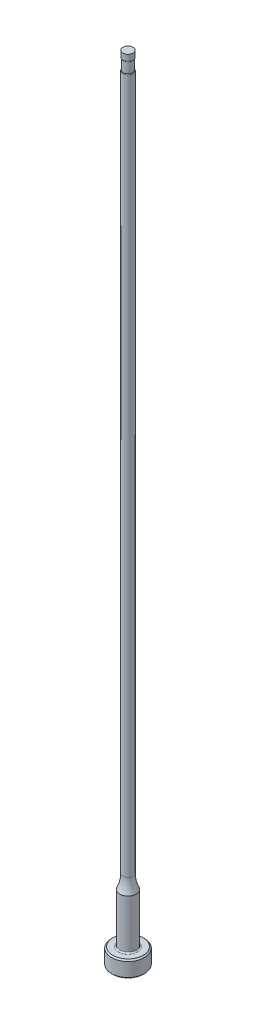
ISO-10303-21;
HEADER;
FILE_DESCRIPTION(('STEP AP214'),'2;1');
FILE_NAME('part.step','',(''),(''),'','','');
FILE_SCHEMA(('AUTOMOTIVE_DESIGN { 1 0 10303 214 1 1 1 1 }'));
ENDSEC;
DATA;
#1=APPLICATION_CONTEXT('core data for automotive mechanical design processes');
#2=APPLICATION_PROTOCOL_DEFINITION('international standard','automotive_design',2000,#1);
#3=PRODUCT_CONTEXT('',#1,'mechanical');
#4=PRODUCT('Part','Part','',(#3));
#5=PRODUCT_RELATED_PRODUCT_CATEGORY('part','',(#4));
#6=PRODUCT_DEFINITION_FORMATION('','',#4);
#7=PRODUCT_DEFINITION_CONTEXT('part definition',#1,'design');
#8=PRODUCT_DEFINITION('design','',#6,#7);
#9=PRODUCT_DEFINITION_SHAPE('','',#8);
#10=(LENGTH_UNIT() NAMED_UNIT(*) SI_UNIT(.MILLI.,.METRE.));
#11=(NAMED_UNIT(*) PLANE_ANGLE_UNIT() SI_UNIT($,.RADIAN.));
#12=(NAMED_UNIT(*) SI_UNIT($,.STERADIAN.) SOLID_ANGLE_UNIT());
#13=UNCERTAINTY_MEASURE_WITH_UNIT(LENGTH_MEASURE(1.E-05),#10,'distance_accuracy_value','');
#14=(GEOMETRIC_REPRESENTATION_CONTEXT(3) GLOBAL_UNCERTAINTY_ASSIGNED_CONTEXT((#13)) GLOBAL_UNIT_ASSIGNED_CONTEXT((#10,
#11,#12)) REPRESENTATION_CONTEXT('',''));
#15=CARTESIAN_POINT('',(0.,0.,0.));
#16=DIRECTION('',(0.,0.,1.));
#17=DIRECTION('',(1.,0.,0.));
#18=AXIS2_PLACEMENT_3D('',#15,#16,#17);
#19=CARTESIAN_POINT('',(0.,259.958771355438,0.));
#20=DIRECTION('',(0.,1.,0.));
#21=DIRECTION('',(0.,0.,1.));
#22=AXIS2_PLACEMENT_3D('',#19,#20,#21);
#23=CYLINDRICAL_SURFACE('',#22,0.991869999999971);
#24=DIRECTION('',(0.,1.,0.));
#25=VECTOR('',#24,1.);
#26=CARTESIAN_POINT('',(-0.890269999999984,259.958771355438,-0.437293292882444));
#27=LINE('',#26,#25);
#28=CARTESIAN_POINT('',(-0.890269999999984,148.973565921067,-0.437293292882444));
#29=VERTEX_POINT('',#28);
#30=CARTESIAN_POINT('',(-0.890269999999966,112.014,-0.43729329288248));
#31=VERTEX_POINT('',#30);
#32=EDGE_CURVE('E66',#29,#31,#27,.F.);
#33=ORIENTED_EDGE('',*,*,#32,.F.);
#34=CARTESIAN_POINT('',(0.,148.973565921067,0.));
#35=DIRECTION('',(0.,1.,0.));
#36=DIRECTION('',(0.,0.,1.));
#37=AXIS2_PLACEMENT_3D('',#34,#35,#36);
#38=CIRCLE('',#37,0.991869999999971);
#39=CARTESIAN_POINT('',(-0.890269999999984,148.973565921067,0.437293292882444));
#40=VERTEX_POINT('',#39);
#41=EDGE_CURVE('E44',#29,#40,#38,.F.);
#42=ORIENTED_EDGE('',*,*,#41,.T.);
#43=DIRECTION('',(0.,1.,0.));
#44=VECTOR('',#43,1.);
#45=CARTESIAN_POINT('',(-0.890269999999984,259.958771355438,0.437293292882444));
#46=LINE('',#45,#44);
#47=CARTESIAN_POINT('',(-0.890269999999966,112.014,0.43729329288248));
#48=VERTEX_POINT('',#47);
#49=EDGE_CURVE('E72',#48,#40,#46,.T.);
#50=ORIENTED_EDGE('',*,*,#49,.F.);
#51=CARTESIAN_POINT('',(-0.890269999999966,112.014,-0.43729329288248));
#52=CARTESIAN_POINT('',(-0.890266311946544,111.980545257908,-0.437278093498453));
#53=CARTESIAN_POINT('',(-0.890798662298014,111.947083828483,-0.436215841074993));
#54=CARTESIAN_POINT('',(-0.89291221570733,111.8802670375,-0.431885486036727));
#55=CARTESIAN_POINT('',(-0.8944956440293,111.846912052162,-0.428612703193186));
#56=CARTESIAN_POINT('',(-0.898710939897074,111.780207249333,-0.419700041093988));
#57=CARTESIAN_POINT('',(-0.901354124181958,111.7468615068,-0.41403457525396));
#58=CARTESIAN_POINT('',(-0.907624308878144,111.680839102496,-0.400103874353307));
#59=CARTESIAN_POINT('',(-0.911250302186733,111.648161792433,-0.391841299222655));
#60=CARTESIAN_POINT('',(-0.919626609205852,111.581872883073,-0.371778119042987));
#61=CARTESIAN_POINT('',(-0.924431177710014,111.54832221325,-0.359795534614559));
#62=CARTESIAN_POINT('',(-0.934806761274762,111.48304822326,-0.331911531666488));
#63=CARTESIAN_POINT('',(-0.940375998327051,111.451320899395,-0.316019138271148));
#64=CARTESIAN_POINT('',(-0.950464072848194,111.398247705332,-0.283956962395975));
#65=CARTESIAN_POINT('',(-0.954903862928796,111.376269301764,-0.268819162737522));
#66=CARTESIAN_POINT('',(-0.963691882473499,111.334821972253,-0.235377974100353));
#67=CARTESIAN_POINT('',(-0.968040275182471,111.315348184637,-0.217080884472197));
#68=CARTESIAN_POINT('',(-0.974794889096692,111.286172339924,-0.183749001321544));
#69=CARTESIAN_POINT('',(-0.977361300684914,111.275390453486,-0.169697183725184));
#70=CARTESIAN_POINT('',(-0.982046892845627,111.256069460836,-0.140050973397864));
#71=CARTESIAN_POINT('',(-0.984166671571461,111.247527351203,-0.124458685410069));
#72=CARTESIAN_POINT('',(-0.987438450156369,111.234502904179,-0.0946420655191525));
#73=CARTESIAN_POINT('',(-0.988692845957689,111.229581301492,-0.080622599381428));
#74=CARTESIAN_POINT('',(-0.990613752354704,111.222085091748,-0.0519284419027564));
#75=CARTESIAN_POINT('',(-0.991280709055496,111.219508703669,-0.0372542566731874));
#76=CARTESIAN_POINT('',(-0.991951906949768,111.21691599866,-0.00760975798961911));
#77=CARTESIAN_POINT('',(-0.99195380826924,111.216908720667,0.00736141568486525));
#78=CARTESIAN_POINT('',(-0.991288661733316,111.219477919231,0.0370648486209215));
#79=CARTESIAN_POINT('',(-0.990621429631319,111.222055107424,0.0517970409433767));
#80=CARTESIAN_POINT('',(-0.988743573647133,111.229383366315,0.0798806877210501));
#81=CARTESIAN_POINT('',(-0.987561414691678,111.234020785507,0.0932643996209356));
#82=CARTESIAN_POINT('',(-0.984768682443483,111.245124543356,0.119193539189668));
#83=CARTESIAN_POINT('',(-0.983157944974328,111.251591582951,0.131738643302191));
#84=CARTESIAN_POINT('',(-0.978661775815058,111.269953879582,0.162424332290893));
#85=CARTESIAN_POINT('',(-0.975558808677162,111.282890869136,0.179909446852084));
#86=CARTESIAN_POINT('',(-0.96896763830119,111.31132520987,0.212571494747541));
#87=CARTESIAN_POINT('',(-0.965478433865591,111.326829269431,0.227742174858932));
#88=CARTESIAN_POINT('',(-0.95629354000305,111.369332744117,0.264288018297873));
#89=CARTESIAN_POINT('',(-0.950512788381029,111.397709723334,0.284029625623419));
#90=CARTESIAN_POINT('',(-0.939335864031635,111.457144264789,0.319042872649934));
#91=CARTESIAN_POINT('',(-0.933940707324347,111.488208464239,0.334303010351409));
#92=CARTESIAN_POINT('',(-0.920397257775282,111.574246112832,0.370513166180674));
#93=CARTESIAN_POINT('',(-0.912954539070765,111.630778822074,0.388004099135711));
#94=CARTESIAN_POINT('',(-0.901068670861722,111.745979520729,0.414830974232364));
#95=CARTESIAN_POINT('',(-0.896628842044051,111.804649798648,0.424157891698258));
#96=CARTESIAN_POINT('',(-0.892643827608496,111.888710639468,0.432432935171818));
#97=CARTESIAN_POINT('',(-0.891752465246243,111.913788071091,0.434264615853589));
#98=CARTESIAN_POINT('',(-0.890566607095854,111.963908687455,0.43669067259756));
#99=CARTESIAN_POINT('',(-0.890269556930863,111.988951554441,0.437290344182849));
#100=CARTESIAN_POINT('',(-0.890269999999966,112.014,0.43729329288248));
#101=B_SPLINE_CURVE_WITH_KNOTS('',3,(#51,#52,#53,#54,#55,#56,#57,#58,#59,#60,#61,#62,#63,#64,
#65,#66,#67,#68,#69,#70,#71,#72,#73,#74,#75,#76,#77,#78,#79,#80,#81,#82,#83,#84,#85,#86,#87,#88,
#89,#90,#91,#92,#93,#94,#95,#96,#97,#98,#99,#100),.UNSPECIFIED.,.F.,.F.,(4,2,2,2,2,2,2,2,2,2,2,
2,2,2,2,2,2,2,2,2,2,2,2,2,4),(0.,0.10035396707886,0.200921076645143,0.302591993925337,
0.404159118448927,0.511798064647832,0.619190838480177,0.700138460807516,0.780926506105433,
0.834449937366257,0.887901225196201,0.93244760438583,0.976960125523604,1.02162925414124,
1.06631068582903,1.10878536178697,1.15127633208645,1.21681290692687,1.28252352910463,
1.38707795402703,1.49189842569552,1.66985552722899,1.84800909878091,1.92345875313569,
1.99858341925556),.UNSPECIFIED.);
#102=EDGE_CURVE('E74',#31,#48,#101,.T.);
#103=ORIENTED_EDGE('',*,*,#102,.F.);
#104=EDGE_LOOP('',(#33,#42,#50,#103));
#105=FACE_BOUND('',#104,.T.);
#106=CARTESIAN_POINT('',(0.,15.3850932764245,0.));
#107=DIRECTION('',(0.,1.,0.));
#108=DIRECTION('',(0.,0.,1.));
#109=AXIS2_PLACEMENT_3D('',#106,#107,#108);
#110=CIRCLE('',#109,0.991869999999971);
#111=CARTESIAN_POINT('',(0.,15.3850932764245,0.991869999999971));
#112=VERTEX_POINT('',#111);
#113=EDGE_CURVE('E95',#112,#112,#110,.T.);
#114=ORIENTED_EDGE('',*,*,#113,.T.);
#115=EDGE_LOOP('',(#114));
#116=FACE_BOUND('',#115,.T.);
#117=ADVANCED_FACE('F36',(#105,#116),#23,.T.);
#118=CARTESIAN_POINT('',(0.,15.3850932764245,0.));
#119=DIRECTION('',(0.,1.,0.));
#120=DIRECTION('',(0.,0.,1.));
#121=AXIS2_PLACEMENT_3D('',#118,#119,#120);
#122=TOROIDAL_SURFACE('',#121,7.34186999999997,6.35);
#123=CARTESIAN_POINT('',(0.,12.7,0.));
#124=DIRECTION('',(0.,1.,0.));
#125=DIRECTION('',(0.,0.,1.));
#126=AXIS2_PLACEMENT_3D('',#123,#124,#125);
#127=CIRCLE('',#126,1.58749999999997);
#128=CARTESIAN_POINT('',(0.,12.7,1.58749999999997));
#129=VERTEX_POINT('',#128);
#130=EDGE_CURVE('E92',#129,#129,#127,.T.);
#131=ORIENTED_EDGE('',*,*,#130,.T.);
#132=EDGE_LOOP('',(#131));
#133=FACE_BOUND('',#132,.T.);
#134=ORIENTED_EDGE('',*,*,#113,.F.);
#135=EDGE_LOOP('',(#134));
#136=FACE_BOUND('',#135,.T.);
#137=ADVANCED_FACE('F156',(#133,#136),#122,.F.);
#138=CARTESIAN_POINT('',(0.,259.958771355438,0.));
#139=DIRECTION('',(0.,1.,0.));
#140=DIRECTION('',(0.,0.,1.));
#141=AXIS2_PLACEMENT_3D('',#138,#139,#140);
#142=CYLINDRICAL_SURFACE('',#141,1.58749999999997);
#143=CARTESIAN_POINT('',(0.,3.42900000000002,0.));
#144=DIRECTION('',(0.,1.,0.));
#145=DIRECTION('',(0.,0.,1.));
#146=AXIS2_PLACEMENT_3D('',#143,#144,#145);
#147=CIRCLE('',#146,1.58749999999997);
#148=CARTESIAN_POINT('',(0.,3.42900000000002,1.58749999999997));
#149=VERTEX_POINT('',#148);
#150=EDGE_CURVE('E110',#149,#149,#147,.T.);
#151=ORIENTED_EDGE('',*,*,#150,.T.);
#152=EDGE_LOOP('',(#151));
#153=FACE_BOUND('',#152,.T.);
#154=ORIENTED_EDGE('',*,*,#130,.F.);
#155=EDGE_LOOP('',(#154));
#156=FACE_BOUND('',#155,.T.);
#157=ADVANCED_FACE('F153',(#153,#156),#142,.T.);
#158=CARTESIAN_POINT('',(-3.17499999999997,3.175,0.));
#159=DIRECTION('',(0.,1.,0.));
#160=DIRECTION('',(0.,0.,1.));
#161=AXIS2_PLACEMENT_3D('',#158,#159,#160);
#162=PLANE('',#161);
#163=CARTESIAN_POINT('',(0.,3.175,0.));
#164=DIRECTION('',(0.,1.,0.));
#165=DIRECTION('',(0.,0.,1.));
#166=AXIS2_PLACEMENT_3D('',#163,#164,#165);
#167=CIRCLE('',#166,1.84149999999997);
#168=CARTESIAN_POINT('',(0.,3.175,1.84149999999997));
#169=VERTEX_POINT('',#168);
#170=EDGE_CURVE('E78',#169,#169,#167,.F.);
#171=ORIENTED_EDGE('',*,*,#170,.T.);
#172=EDGE_LOOP('',(#171));
#173=FACE_BOUND('',#172,.T.);
#174=CARTESIAN_POINT('',(0.,3.175,0.));
#175=DIRECTION('',(0.,1.,0.));
#176=DIRECTION('',(0.,0.,1.));
#177=AXIS2_PLACEMENT_3D('',#174,#175,#176);
#178=CIRCLE('',#177,2.92099999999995);
#179=CARTESIAN_POINT('',(0.,3.175,2.92099999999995));
#180=VERTEX_POINT('',#179);
#181=EDGE_CURVE('E98',#180,#180,#178,.T.);
#182=ORIENTED_EDGE('',*,*,#181,.T.);
#183=EDGE_LOOP('',(#182));
#184=FACE_BOUND('',#183,.T.);
#185=ADVANCED_FACE('F149',(#173,#184),#162,.T.);
#186=CARTESIAN_POINT('',(0.,259.958771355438,0.));
#187=DIRECTION('',(0.,1.,0.));
#188=DIRECTION('',(0.,0.,1.));
#189=AXIS2_PLACEMENT_3D('',#186,#187,#188);
#190=CYLINDRICAL_SURFACE('',#189,3.17499999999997);
#191=CARTESIAN_POINT('',(0.,2.92100000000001,0.));
#192=DIRECTION('',(0.,1.,0.));
#193=DIRECTION('',(0.,0.,1.));
#194=AXIS2_PLACEMENT_3D('',#191,#192,#193);
#195=CIRCLE('',#194,3.17499999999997);
#196=CARTESIAN_POINT('',(0.,2.92100000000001,3.17499999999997));
#197=VERTEX_POINT('',#196);
#198=EDGE_CURVE('E104',#197,#197,#195,.F.);
#199=ORIENTED_EDGE('',*,*,#198,.T.);
#200=EDGE_LOOP('',(#199));
#201=FACE_BOUND('',#200,.T.);
#202=CARTESIAN_POINT('',(0.,0.254000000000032,0.));
#203=DIRECTION('',(0.,-1.,0.));
#204=DIRECTION('',(0.,0.,-1.));
#205=AXIS2_PLACEMENT_3D('',#202,#203,#204);
#206=CIRCLE('',#205,3.17499999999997);
#207=CARTESIAN_POINT('',(0.,0.254000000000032,-3.17499999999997));
#208=VERTEX_POINT('',#207);
#209=EDGE_CURVE('E101',#208,#208,#206,.F.);
#210=ORIENTED_EDGE('',*,*,#209,.T.);
#211=EDGE_LOOP('',(#210));
#212=FACE_BOUND('',#211,.T.);
#213=ADVANCED_FACE('F145',(#201,#212),#190,.T.);
#214=CARTESIAN_POINT('',(0.,0.,0.));
#215=DIRECTION('',(0.,-1.,0.));
#216=DIRECTION('',(0.,0.,-1.));
#217=AXIS2_PLACEMENT_3D('',#214,#215,#216);
#218=PLANE('',#217);
#219=CARTESIAN_POINT('',(0.,0.,0.));
#220=DIRECTION('',(0.,-1.,0.));
#221=DIRECTION('',(0.,0.,-1.));
#222=AXIS2_PLACEMENT_3D('',#219,#220,#221);
#223=CIRCLE('',#222,2.92099999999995);
#224=CARTESIAN_POINT('',(0.,0.,-2.92099999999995));
#225=VERTEX_POINT('',#224);
#226=EDGE_CURVE('E107',#225,#225,#223,.T.);
#227=ORIENTED_EDGE('',*,*,#226,.T.);
#228=EDGE_LOOP('',(#227));
#229=FACE_BOUND('',#228,.T.);
#230=ADVANCED_FACE('F141',(#229),#218,.T.);
#231=CARTESIAN_POINT('',(0.,3.17499999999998,0.));
#232=DIRECTION('',(0.,-1.,0.));
#233=DIRECTION('',(0.,0.,-1.));
#234=AXIS2_PLACEMENT_3D('',#231,#232,#233);
#235=CONICAL_SURFACE('',#234,2.92099999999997,0.7853981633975);
#236=ORIENTED_EDGE('',*,*,#198,.F.);
#237=EDGE_LOOP('',(#236));
#238=FACE_BOUND('',#237,.T.);
#239=ORIENTED_EDGE('',*,*,#181,.F.);
#240=EDGE_LOOP('',(#239));
#241=FACE_BOUND('',#240,.T.);
#242=ADVANCED_FACE('F144',(#238,#241),#235,.T.);
#243=CARTESIAN_POINT('',(0.,0.254000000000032,0.));
#244=DIRECTION('',(0.,1.,0.));
#245=DIRECTION('',(0.,0.,1.));
#246=AXIS2_PLACEMENT_3D('',#243,#244,#245);
#247=CONICAL_SURFACE('',#246,3.17499999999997,0.785398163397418);
#248=ORIENTED_EDGE('',*,*,#226,.F.);
#249=EDGE_LOOP('',(#248));
#250=FACE_BOUND('',#249,.T.);
#251=ORIENTED_EDGE('',*,*,#209,.F.);
#252=EDGE_LOOP('',(#251));
#253=FACE_BOUND('',#252,.T.);
#254=ADVANCED_FACE('F245',(#250,#253),#247,.T.);
#255=CARTESIAN_POINT('',(0.,3.42900000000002,0.));
#256=DIRECTION('',(0.,1.,0.));
#257=DIRECTION('',(0.,0.,1.));
#258=AXIS2_PLACEMENT_3D('',#255,#256,#257);
#259=TOROIDAL_SURFACE('',#258,1.84149999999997,0.254);
#260=ORIENTED_EDGE('',*,*,#170,.F.);
#261=EDGE_LOOP('',(#260));
#262=FACE_BOUND('',#261,.T.);
#263=ORIENTED_EDGE('',*,*,#150,.F.);
#264=EDGE_LOOP('',(#263));
#265=FACE_BOUND('',#264,.T.);
#266=ADVANCED_FACE('F139',(#262,#265),#259,.F.);
#267=CARTESIAN_POINT('',(0.,153.448281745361,0.));
#268=DIRECTION('',(0.,1.,0.));
#269=DIRECTION('',(0.,0.,1.));
#270=AXIS2_PLACEMENT_3D('',#267,#268,#269);
#271=CYLINDRICAL_SURFACE('',#270,0.890269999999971);
#272=CARTESIAN_POINT('',(0.,151.13,0.));
#273=DIRECTION('',(0.,1.,0.));
#274=DIRECTION('',(0.,0.,1.));
#275=AXIS2_PLACEMENT_3D('',#272,#273,#274);
#276=CIRCLE('',#275,0.890269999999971);
#277=CARTESIAN_POINT('',(0.,151.13,0.890269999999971));
#278=VERTEX_POINT('',#277);
#279=EDGE_CURVE('E71',#278,#278,#276,.T.);
#280=ORIENTED_EDGE('',*,*,#279,.F.);
#281=EDGE_LOOP('',(#280));
#282=FACE_BOUND('',#281,.T.);
#283=CARTESIAN_POINT('',(0.,149.098,0.));
#284=DIRECTION('',(0.,1.,0.));
#285=DIRECTION('',(0.,0.,1.));
#286=AXIS2_PLACEMENT_3D('',#283,#284,#285);
#287=CIRCLE('',#286,0.89026999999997);
#288=CARTESIAN_POINT('',(-0.890269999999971,149.098,0.));
#289=VERTEX_POINT('',#288);
#290=EDGE_CURVE('E89',#289,#289,#287,.T.);
#291=ORIENTED_EDGE('',*,*,#290,.T.);
#292=EDGE_LOOP('',(#291));
#293=FACE_BOUND('',#292,.T.);
#294=ADVANCED_FACE('F136',(#282,#293),#271,.T.);
#295=CARTESIAN_POINT('',(-0.890269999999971,150.114,-3.17499999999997));
#296=DIRECTION('',(1.,0.,0.));
#297=DIRECTION('',(0.,1.,0.));
#298=AXIS2_PLACEMENT_3D('',#295,#296,#297);
#299=PLANE('',#298);
#300=CARTESIAN_POINT('',(-0.890269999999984,148.973565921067,0.437293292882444));
#301=CARTESIAN_POINT('',(-0.890269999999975,148.976968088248,0.437301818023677));
#302=CARTESIAN_POINT('',(-0.890269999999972,148.980360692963,0.436983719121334));
#303=CARTESIAN_POINT('',(-0.890269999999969,148.987009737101,0.43576958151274));
#304=CARTESIAN_POINT('',(-0.89026999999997,148.990267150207,0.434878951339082));
#305=CARTESIAN_POINT('',(-0.890269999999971,148.996585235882,0.43259622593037));
#306=CARTESIAN_POINT('',(-0.890269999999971,148.999646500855,0.431205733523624));
#307=CARTESIAN_POINT('',(-0.89026999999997,149.005552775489,0.428014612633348));
#308=CARTESIAN_POINT('',(-0.89026999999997,149.008397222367,0.426212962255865));
#309=CARTESIAN_POINT('',(-0.89026999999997,149.015805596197,0.420882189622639));
#310=CARTESIAN_POINT('',(-0.89026999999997,149.02014344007,0.417039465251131));
#311=CARTESIAN_POINT('',(-0.89026999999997,149.028182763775,0.408741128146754));
#312=CARTESIAN_POINT('',(-0.89026999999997,149.031882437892,0.404283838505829));
#313=CARTESIAN_POINT('',(-0.89026999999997,149.0415289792,0.391183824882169));
#314=CARTESIAN_POINT('',(-0.89026999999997,149.046853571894,0.382087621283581));
#315=CARTESIAN_POINT('',(-0.89026999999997,149.056198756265,0.363263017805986));
#316=CARTESIAN_POINT('',(-0.89026999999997,149.060215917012,0.353533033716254));
#317=CARTESIAN_POINT('',(-0.89026999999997,149.069122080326,0.32859875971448));
#318=CARTESIAN_POINT('',(-0.89026999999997,149.07338200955,0.313173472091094));
#319=CARTESIAN_POINT('',(-0.89026999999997,149.080438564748,0.281981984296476));
#320=CARTESIAN_POINT('',(-0.89026999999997,149.083231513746,0.266215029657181));
#321=CARTESIAN_POINT('',(-0.89026999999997,149.090162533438,0.218503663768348));
#322=CARTESIAN_POINT('',(-0.89026999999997,149.092797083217,0.186351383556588));
#323=CARTESIAN_POINT('',(-0.89026999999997,149.095945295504,0.128280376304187));
#324=CARTESIAN_POINT('',(-0.89026999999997,149.09677238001,0.102368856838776));
#325=CARTESIAN_POINT('',(-0.89026999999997,149.097538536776,0.0637070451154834));
#326=CARTESIAN_POINT('',(-0.89026999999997,149.097715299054,0.0509633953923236));
#327=CARTESIAN_POINT('',(-0.89026999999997,149.097944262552,0.0254795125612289));
#328=CARTESIAN_POINT('',(-0.89026999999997,149.097996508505,0.012739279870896));
#329=CARTESIAN_POINT('',(-0.89026999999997,149.098000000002,1.16242336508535E-13));
#330=B_SPLINE_CURVE_WITH_KNOTS('',3,(#300,#301,#302,#303,#304,#305,#306,#307,#308,#309,#310,
#311,#312,#313,#314,#315,#316,#317,#318,#319,#320,#321,#322,#323,#324,#325,#326,#327,#328,#329),
.UNSPECIFIED.,.F.,.F.,(4,2,2,2,2,2,2,2,2,2,2,2,2,2,4),(0.,0.010176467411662,0.0202581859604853,
0.0303078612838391,0.0403827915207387,0.0576671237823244,0.0749995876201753,0.106441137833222,
0.137964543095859,0.185843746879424,0.233842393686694,0.330464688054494,0.408243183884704,
0.446476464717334,0.484696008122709),.UNSPECIFIED.);
#331=EDGE_CURVE('E77',#40,#289,#330,.T.);
#332=ORIENTED_EDGE('',*,*,#331,.T.);
#333=CARTESIAN_POINT('',(-0.89026999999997,149.098,0.));
#334=CARTESIAN_POINT('',(-0.89026999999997,149.097969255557,-0.0211447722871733));
#335=CARTESIAN_POINT('',(-0.89026999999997,149.097844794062,-0.0422938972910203));
#336=CARTESIAN_POINT('',(-0.89026999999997,149.097189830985,-0.084646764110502));
#337=CARTESIAN_POINT('',(-0.89026999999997,149.096658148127,-0.105850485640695));
#338=CARTESIAN_POINT('',(-0.89026999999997,149.094965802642,-0.148284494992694));
#339=CARTESIAN_POINT('',(-0.89026999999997,149.09380367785,-0.16951472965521));
#340=CARTESIAN_POINT('',(-0.89026999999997,149.090394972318,-0.211874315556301));
#341=CARTESIAN_POINT('',(-0.89026999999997,149.088149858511,-0.233003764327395));
#342=CARTESIAN_POINT('',(-0.89026999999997,149.083358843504,-0.264920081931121));
#343=CARTESIAN_POINT('',(-0.89026999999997,149.081474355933,-0.275804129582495));
#344=CARTESIAN_POINT('',(-0.89026999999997,149.077051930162,-0.297473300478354));
#345=CARTESIAN_POINT('',(-0.89026999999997,149.074512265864,-0.308258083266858));
#346=CARTESIAN_POINT('',(-0.89026999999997,149.068067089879,-0.33143887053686));
#347=CARTESIAN_POINT('',(-0.89026999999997,149.064001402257,-0.343791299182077));
#348=CARTESIAN_POINT('',(-0.89026999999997,149.054220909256,-0.36781517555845));
#349=CARTESIAN_POINT('',(-0.89026999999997,149.048514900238,-0.379489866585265));
#350=CARTESIAN_POINT('',(-0.89026999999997,149.038928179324,-0.394623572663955));
#351=CARTESIAN_POINT('',(-0.89026999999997,149.036075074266,-0.398729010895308));
#352=CARTESIAN_POINT('',(-0.89026999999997,149.029937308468,-0.406618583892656));
#353=CARTESIAN_POINT('',(-0.89026999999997,149.02665209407,-0.410402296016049));
#354=CARTESIAN_POINT('',(-0.89026999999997,149.019554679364,-0.417536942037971));
#355=CARTESIAN_POINT('',(-0.89026999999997,149.015736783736,-0.420882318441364));
#356=CARTESIAN_POINT('',(-0.89026999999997,149.007570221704,-0.426851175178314));
#357=CARTESIAN_POINT('',(-0.89026999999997,149.003223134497,-0.429476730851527));
#358=CARTESIAN_POINT('',(-0.89026999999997,148.995577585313,-0.433007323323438));
#359=CARTESIAN_POINT('',(-0.89026999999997,148.992409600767,-0.43419417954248));
#360=CARTESIAN_POINT('',(-0.89026999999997,148.985923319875,-0.436020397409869));
#361=CARTESIAN_POINT('',(-0.89026999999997,148.982605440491,-0.436661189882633));
#362=CARTESIAN_POINT('',(-0.89026999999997,148.97736752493,-0.437197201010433));
#363=CARTESIAN_POINT('',(-0.89026999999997,148.975466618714,-0.437295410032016));
#364=CARTESIAN_POINT('',(-0.89026999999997,148.973565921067,-0.437293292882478));
#365=B_SPLINE_CURVE_WITH_KNOTS('',3,(#333,#334,#335,#336,#337,#338,#339,#340,#341,#342,#343,
#344,#345,#346,#347,#348,#349,#350,#351,#352,#353,#354,#355,#356,#357,#358,#359,#360,#361,#362,
#363,#364),.UNSPECIFIED.,.F.,.F.,(4,2,2,2,2,2,2,2,2,2,2,2,2,2,2,4),(0.,0.0634413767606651,
0.127067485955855,0.19084179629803,0.254529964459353,0.287653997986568,0.32086620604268,
0.359816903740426,0.398562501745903,0.413539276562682,0.428535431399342,0.443706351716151,
0.4588330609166,0.468942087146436,0.479024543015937,0.484725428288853),.UNSPECIFIED.);
#366=EDGE_CURVE('E58',#289,#29,#365,.T.);
#367=ORIENTED_EDGE('',*,*,#366,.T.);
#368=ORIENTED_EDGE('',*,*,#32,.T.);
#369=DIRECTION('',(0.,0.,1.));
#370=VECTOR('',#369,1.);
#371=CARTESIAN_POINT('',(-0.890269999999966,112.014,-3.17499999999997));
#372=LINE('',#371,#370);
#373=EDGE_CURVE('E70',#31,#48,#372,.T.);
#374=ORIENTED_EDGE('',*,*,#373,.T.);
#375=ORIENTED_EDGE('',*,*,#49,.T.);
#376=EDGE_LOOP('',(#332,#367,#368,#374,#375));
#377=FACE_BOUND('',#376,.T.);
#378=ADVANCED_FACE('F68',(#377),#299,.F.);
#379=CARTESIAN_POINT('',(-4.06526999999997,112.014,-3.17499999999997));
#380=DIRECTION('',(0.,0.,1.));
#381=DIRECTION('',(1.,0.,0.));
#382=AXIS2_PLACEMENT_3D('',#379,#380,#381);
#383=CYLINDRICAL_SURFACE('',#382,3.175);
#384=ORIENTED_EDGE('',*,*,#373,.F.);
#385=ORIENTED_EDGE('',*,*,#102,.T.);
#386=EDGE_LOOP('',(#384,#385));
#387=FACE_BOUND('',#386,.T.);
#388=ADVANCED_FACE('F80',(#387),#383,.F.);
#389=CARTESIAN_POINT('',(0.,152.687735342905,0.));
#390=DIRECTION('',(0.,1.,0.));
#391=DIRECTION('',(0.,0.,1.));
#392=AXIS2_PLACEMENT_3D('',#389,#390,#391);
#393=CYLINDRICAL_SURFACE('',#392,0.979169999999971);
#394=CARTESIAN_POINT('',(0.,151.25115027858,0.));
#395=DIRECTION('',(0.,-1.,0.));
#396=DIRECTION('',(0.,0.,-1.));
#397=AXIS2_PLACEMENT_3D('',#394,#395,#396);
#398=CIRCLE('',#397,0.979169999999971);
#399=CARTESIAN_POINT('',(0.,151.25115027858,-0.979169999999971));
#400=VERTEX_POINT('',#399);
#401=EDGE_CURVE('E11',#400,#400,#398,.F.);
#402=ORIENTED_EDGE('',*,*,#401,.T.);
#403=EDGE_LOOP('',(#402));
#404=FACE_BOUND('',#403,.T.);
#405=CARTESIAN_POINT('',(0.,152.4,0.));
#406=DIRECTION('',(0.,1.,0.));
#407=DIRECTION('',(0.,0.,1.));
#408=AXIS2_PLACEMENT_3D('',#405,#406,#407);
#409=CIRCLE('',#408,0.979169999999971);
#410=CARTESIAN_POINT('',(0.,152.4,0.979169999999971));
#411=VERTEX_POINT('',#410);
#412=EDGE_CURVE('E81',#411,#411,#409,.T.);
#413=ORIENTED_EDGE('',*,*,#412,.F.);
#414=EDGE_LOOP('',(#413));
#415=FACE_BOUND('',#414,.T.);
#416=ADVANCED_FACE('F133',(#404,#415),#393,.T.);
#417=CARTESIAN_POINT('',(-0.99186999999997,152.4,0.));
#418=DIRECTION('',(0.,1.,0.));
#419=DIRECTION('',(0.,0.,1.));
#420=AXIS2_PLACEMENT_3D('',#417,#418,#419);
#421=PLANE('',#420);
#422=ORIENTED_EDGE('',*,*,#412,.T.);
#423=EDGE_LOOP('',(#422));
#424=FACE_BOUND('',#423,.T.);
#425=ADVANCED_FACE('F177',(#424),#421,.T.);
#426=CARTESIAN_POINT('',(0.,148.973565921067,0.));
#427=DIRECTION('',(0.,1.,0.));
#428=DIRECTION('',(0.,0.,1.));
#429=AXIS2_PLACEMENT_3D('',#426,#427,#428);
#430=TOROIDAL_SURFACE('',#429,0.864869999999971,0.127);
#431=ORIENTED_EDGE('',*,*,#331,.F.);
#432=ORIENTED_EDGE('',*,*,#41,.F.);
#433=ORIENTED_EDGE('',*,*,#366,.F.);
#434=ORIENTED_EDGE('',*,*,#290,.F.);
#435=EDGE_LOOP('',(#431,#432,#433,#434));
#436=FACE_BOUND('',#435,.T.);
#437=ADVANCED_FACE('F209',(#436),#430,.T.);
#438=CARTESIAN_POINT('',(0.,151.25115027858,0.));
#439=DIRECTION('',(0.,-1.,0.));
#440=DIRECTION('',(0.,0.,-1.));
#441=AXIS2_PLACEMENT_3D('',#438,#439,#440);
#442=TOROIDAL_SURFACE('',#441,0.852169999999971,0.127);
#443=ORIENTED_EDGE('',*,*,#279,.T.);
#444=EDGE_LOOP('',(#443));
#445=FACE_BOUND('',#444,.T.);
#446=ORIENTED_EDGE('',*,*,#401,.F.);
#447=EDGE_LOOP('',(#446));
#448=FACE_BOUND('',#447,.T.);
#449=ADVANCED_FACE('F38',(#445,#448),#442,.T.);
#450=CLOSED_SHELL('',(#117,#137,#157,#185,#213,#230,#242,#254,#266,#294,#378,#388,#416,#425,
#437,#449));
#451=MANIFOLD_SOLID_BREP('B2',#450);
#452=ADVANCED_BREP_SHAPE_REPRESENTATION('',(#18,#451),#14);
#453=SHAPE_DEFINITION_REPRESENTATION(#9,#452);
ENDSEC;
END-ISO-10303-21;
